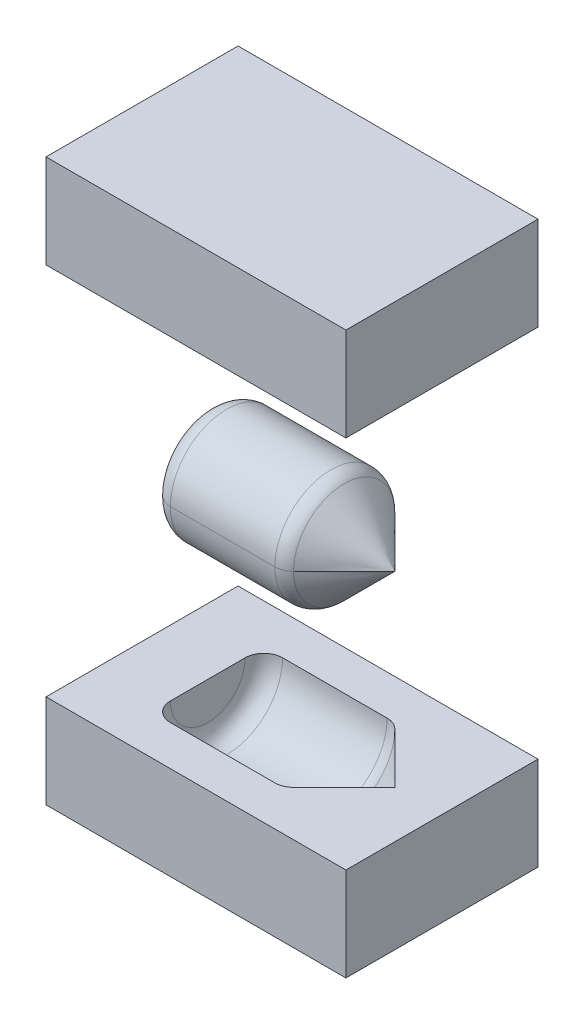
ISO-10303-21;
HEADER;
FILE_DESCRIPTION(('STEP AP214'),'2;1');
FILE_NAME('part.step','',(''),(''),'','','');
FILE_SCHEMA(('AUTOMOTIVE_DESIGN { 1 0 10303 214 1 1 1 1 }'));
ENDSEC;
DATA;
#1=APPLICATION_CONTEXT('core data for automotive mechanical design processes');
#2=APPLICATION_PROTOCOL_DEFINITION('international standard','automotive_design',2000,#1);
#3=PRODUCT_CONTEXT('',#1,'mechanical');
#4=PRODUCT('Part','Part','',(#3));
#5=PRODUCT_RELATED_PRODUCT_CATEGORY('part','',(#4));
#6=PRODUCT_DEFINITION_FORMATION('','',#4);
#7=PRODUCT_DEFINITION_CONTEXT('part definition',#1,'design');
#8=PRODUCT_DEFINITION('design','',#6,#7);
#9=PRODUCT_DEFINITION_SHAPE('','',#8);
#10=(LENGTH_UNIT() NAMED_UNIT(*) SI_UNIT(.MILLI.,.METRE.));
#11=(NAMED_UNIT(*) PLANE_ANGLE_UNIT() SI_UNIT($,.RADIAN.));
#12=(NAMED_UNIT(*) SI_UNIT($,.STERADIAN.) SOLID_ANGLE_UNIT());
#13=UNCERTAINTY_MEASURE_WITH_UNIT(LENGTH_MEASURE(1.E-05),#10,'distance_accuracy_value','');
#14=(GEOMETRIC_REPRESENTATION_CONTEXT(3) GLOBAL_UNCERTAINTY_ASSIGNED_CONTEXT((#13)) GLOBAL_UNIT_ASSIGNED_CONTEXT((#10,
#11,#12)) REPRESENTATION_CONTEXT('',''));
#15=CARTESIAN_POINT('',(0.,0.,0.));
#16=DIRECTION('',(0.,0.,1.));
#17=DIRECTION('',(1.,0.,0.));
#18=AXIS2_PLACEMENT_3D('',#15,#16,#17);
#19=CARTESIAN_POINT('',(0.,-150.,0.));
#20=DIRECTION('',(0.,-1.,0.));
#21=DIRECTION('',(0.,0.,-1.));
#22=AXIS2_PLACEMENT_3D('',#19,#20,#21);
#23=PLANE('',#22);
#24=DIRECTION('',(0.,0.,1.));
#25=VECTOR('',#24,1.);
#26=CARTESIAN_POINT('',(125.198028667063,-150.,51.3368209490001));
#27=LINE('',#26,#25);
#28=CARTESIAN_POINT('',(125.198028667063,-150.,-51.3368209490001));
#29=VERTEX_POINT('',#28);
#30=CARTESIAN_POINT('',(125.198028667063,-150.,51.3368209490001));
#31=VERTEX_POINT('',#30);
#32=EDGE_CURVE('E827',#29,#31,#27,.T.);
#33=ORIENTED_EDGE('',*,*,#32,.T.);
#34=DIRECTION('',(-1.,0.,0.));
#35=VECTOR('',#34,1.);
#36=CARTESIAN_POINT('',(-35.1366174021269,-150.,51.3368209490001));
#37=LINE('',#36,#35);
#38=CARTESIAN_POINT('',(-35.1366174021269,-150.,51.3368209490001));
#39=VERTEX_POINT('',#38);
#40=EDGE_CURVE('E835',#31,#39,#37,.T.);
#41=ORIENTED_EDGE('',*,*,#40,.T.);
#42=DIRECTION('',(0.,0.,-1.));
#43=VECTOR('',#42,1.);
#44=CARTESIAN_POINT('',(-35.1366174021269,-150.,51.3368209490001));
#45=LINE('',#44,#43);
#46=CARTESIAN_POINT('',(-35.1366174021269,-150.,-51.3368209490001));
#47=VERTEX_POINT('',#46);
#48=EDGE_CURVE('E841',#39,#47,#45,.T.);
#49=ORIENTED_EDGE('',*,*,#48,.T.);
#50=DIRECTION('',(1.,0.,0.));
#51=VECTOR('',#50,1.);
#52=CARTESIAN_POINT('',(-35.1366174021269,-150.,-51.3368209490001));
#53=LINE('',#52,#51);
#54=EDGE_CURVE('E833',#47,#29,#53,.T.);
#55=ORIENTED_EDGE('',*,*,#54,.T.);
#56=EDGE_LOOP('',(#33,#41,#49,#55));
#57=FACE_BOUND('',#56,.T.);
#58=ADVANCED_FACE('F745',(#57),#23,.T.);
#59=CARTESIAN_POINT('',(-35.1366174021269,-50.,51.3368209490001));
#60=DIRECTION('',(0.,0.,1.));
#61=DIRECTION('',(1.,0.,0.));
#62=AXIS2_PLACEMENT_3D('',#59,#60,#61);
#63=PLANE('',#62);
#64=DIRECTION('',(0.,-1.,0.));
#65=VECTOR('',#64,1.);
#66=CARTESIAN_POINT('',(125.198028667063,-50.,51.3368209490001));
#67=LINE('',#66,#65);
#68=CARTESIAN_POINT('',(125.198028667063,-100.,51.3368209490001));
#69=VERTEX_POINT('',#68);
#70=EDGE_CURVE('E823',#69,#31,#67,.T.);
#71=ORIENTED_EDGE('',*,*,#70,.F.);
#72=DIRECTION('',(-1.,0.,0.));
#73=VECTOR('',#72,1.);
#74=CARTESIAN_POINT('',(-35.1366174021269,-100.,51.3368209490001));
#75=LINE('',#74,#73);
#76=CARTESIAN_POINT('',(-35.1366174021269,-100.,51.3368209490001));
#77=VERTEX_POINT('',#76);
#78=EDGE_CURVE('E749',#69,#77,#75,.T.);
#79=ORIENTED_EDGE('',*,*,#78,.T.);
#80=DIRECTION('',(0.,-1.,0.));
#81=VECTOR('',#80,1.);
#82=CARTESIAN_POINT('',(-35.1366174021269,-50.,51.3368209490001));
#83=LINE('',#82,#81);
#84=EDGE_CURVE('E832',#77,#39,#83,.T.);
#85=ORIENTED_EDGE('',*,*,#84,.T.);
#86=ORIENTED_EDGE('',*,*,#40,.F.);
#87=EDGE_LOOP('',(#71,#79,#85,#86));
#88=FACE_BOUND('',#87,.T.);
#89=ADVANCED_FACE('F836',(#88),#63,.T.);
#90=CARTESIAN_POINT('',(-35.1366174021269,-50.,51.3368209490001));
#91=DIRECTION('',(-1.,0.,0.));
#92=DIRECTION('',(0.,0.,1.));
#93=AXIS2_PLACEMENT_3D('',#90,#91,#92);
#94=PLANE('',#93);
#95=ORIENTED_EDGE('',*,*,#84,.F.);
#96=DIRECTION('',(0.,0.,-1.));
#97=VECTOR('',#96,1.);
#98=CARTESIAN_POINT('',(-35.1366174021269,-100.,51.3368209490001));
#99=LINE('',#98,#97);
#100=CARTESIAN_POINT('',(-35.1366174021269,-100.,-51.3368209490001));
#101=VERTEX_POINT('',#100);
#102=EDGE_CURVE('E858',#77,#101,#99,.T.);
#103=ORIENTED_EDGE('',*,*,#102,.T.);
#104=DIRECTION('',(0.,-1.,0.));
#105=VECTOR('',#104,1.);
#106=CARTESIAN_POINT('',(-35.1366174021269,-50.,-51.3368209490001));
#107=LINE('',#106,#105);
#108=EDGE_CURVE('E852',#101,#47,#107,.T.);
#109=ORIENTED_EDGE('',*,*,#108,.T.);
#110=ORIENTED_EDGE('',*,*,#48,.F.);
#111=EDGE_LOOP('',(#95,#103,#109,#110));
#112=FACE_BOUND('',#111,.T.);
#113=ADVANCED_FACE('F857',(#112),#94,.T.);
#114=CARTESIAN_POINT('',(-35.1366174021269,-50.,-51.3368209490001));
#115=DIRECTION('',(0.,0.,-1.));
#116=DIRECTION('',(-1.,0.,0.));
#117=AXIS2_PLACEMENT_3D('',#114,#115,#116);
#118=PLANE('',#117);
#119=ORIENTED_EDGE('',*,*,#108,.F.);
#120=DIRECTION('',(1.,0.,0.));
#121=VECTOR('',#120,1.);
#122=CARTESIAN_POINT('',(-35.1366174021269,-100.,-51.3368209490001));
#123=LINE('',#122,#121);
#124=CARTESIAN_POINT('',(125.198028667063,-100.,-51.3368209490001));
#125=VERTEX_POINT('',#124);
#126=EDGE_CURVE('E862',#101,#125,#123,.T.);
#127=ORIENTED_EDGE('',*,*,#126,.T.);
#128=DIRECTION('',(0.,-1.,0.));
#129=VECTOR('',#128,1.);
#130=CARTESIAN_POINT('',(125.198028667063,-50.,-51.3368209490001));
#131=LINE('',#130,#129);
#132=EDGE_CURVE('E850',#125,#29,#131,.T.);
#133=ORIENTED_EDGE('',*,*,#132,.T.);
#134=ORIENTED_EDGE('',*,*,#54,.F.);
#135=EDGE_LOOP('',(#119,#127,#133,#134));
#136=FACE_BOUND('',#135,.T.);
#137=ADVANCED_FACE('F861',(#136),#118,.T.);
#138=CARTESIAN_POINT('',(125.198028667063,-50.,51.3368209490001));
#139=DIRECTION('',(1.,0.,0.));
#140=DIRECTION('',(0.,0.,-1.));
#141=AXIS2_PLACEMENT_3D('',#138,#139,#140);
#142=PLANE('',#141);
#143=ORIENTED_EDGE('',*,*,#132,.F.);
#144=DIRECTION('',(0.,0.,1.));
#145=VECTOR('',#144,1.);
#146=CARTESIAN_POINT('',(125.198028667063,-100.,51.3368209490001));
#147=LINE('',#146,#145);
#148=EDGE_CURVE('E829',#125,#69,#147,.T.);
#149=ORIENTED_EDGE('',*,*,#148,.T.);
#150=ORIENTED_EDGE('',*,*,#70,.T.);
#151=ORIENTED_EDGE('',*,*,#32,.F.);
#152=EDGE_LOOP('',(#143,#149,#150,#151));
#153=FACE_BOUND('',#152,.T.);
#154=ADVANCED_FACE('F747',(#153),#142,.T.);
#155=CARTESIAN_POINT('',(100.,-100.,0.));
#156=DIRECTION('',(-1.,0.,0.));
#157=DIRECTION('',(0.,0.,1.));
#158=AXIS2_PLACEMENT_3D('',#155,#156,#157);
#159=CONICAL_SURFACE('',#158,0.,0.785398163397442);
#160=DIRECTION('',(0.707106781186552,0.,0.707106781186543));
#161=VECTOR('',#160,1.);
#162=CARTESIAN_POINT('',(100.,-100.,0.));
#163=LINE('',#162,#161);
#164=CARTESIAN_POINT('',(72.9289321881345,-100.,-27.0710678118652));
#165=VERTEX_POINT('',#164);
#166=CARTESIAN_POINT('',(100.,-100.,0.));
#167=VERTEX_POINT('',#166);
#168=EDGE_CURVE('E864',#165,#167,#163,.T.);
#169=ORIENTED_EDGE('',*,*,#168,.F.);
#170=CARTESIAN_POINT('',(72.9289321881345,-100.,0.));
#171=DIRECTION('',(1.,0.,0.));
#172=DIRECTION('',(0.,0.,-1.));
#173=AXIS2_PLACEMENT_3D('',#170,#171,#172);
#174=CIRCLE('',#173,27.0710678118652);
#175=CARTESIAN_POINT('',(72.9289321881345,-100.,27.0710678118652));
#176=VERTEX_POINT('',#175);
#177=EDGE_CURVE('E880',#176,#165,#174,.T.);
#178=ORIENTED_EDGE('',*,*,#177,.F.);
#179=DIRECTION('',(-0.707106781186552,0.,0.707106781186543));
#180=VECTOR('',#179,1.);
#181=CARTESIAN_POINT('',(100.,-100.,0.));
#182=LINE('',#181,#180);
#183=EDGE_CURVE('E889',#167,#176,#182,.T.);
#184=ORIENTED_EDGE('',*,*,#183,.F.);
#185=EDGE_LOOP('',(#169,#178,#184));
#186=FACE_BOUND('',#185,.T.);
#187=ADVANCED_FACE('F909',(#186),#159,.F.);
#188=CARTESIAN_POINT('',(65.8578643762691,-100.,0.));
#189=DIRECTION('',(-1.,0.,0.));
#190=DIRECTION('',(0.,0.,1.));
#191=AXIS2_PLACEMENT_3D('',#188,#189,#190);
#192=TOROIDAL_SURFACE('',#191,19.9999999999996,10.);
#193=ORIENTED_EDGE('',*,*,#177,.T.);
#194=CARTESIAN_POINT('',(65.8578643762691,-100.,-19.9999999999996));
#195=DIRECTION('',(0.,1.,0.));
#196=DIRECTION('',(0.,0.,1.));
#197=AXIS2_PLACEMENT_3D('',#194,#195,#196);
#198=CIRCLE('',#197,10.);
#199=CARTESIAN_POINT('',(65.8578643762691,-100.,-29.9999999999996));
#200=VERTEX_POINT('',#199);
#201=EDGE_CURVE('E788',#200,#165,#198,.F.);
#202=ORIENTED_EDGE('',*,*,#201,.F.);
#203=CARTESIAN_POINT('',(65.8578643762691,-100.,0.));
#204=DIRECTION('',(-1.,0.,0.));
#205=DIRECTION('',(0.,0.,1.));
#206=AXIS2_PLACEMENT_3D('',#203,#204,#205);
#207=CIRCLE('',#206,29.9999999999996);
#208=CARTESIAN_POINT('',(65.8578643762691,-100.,29.9999999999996));
#209=VERTEX_POINT('',#208);
#210=EDGE_CURVE('E879',#200,#209,#207,.T.);
#211=ORIENTED_EDGE('',*,*,#210,.T.);
#212=CARTESIAN_POINT('',(65.8578643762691,-100.,19.9999999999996));
#213=DIRECTION('',(0.,-1.,0.));
#214=DIRECTION('',(0.,0.,-1.));
#215=AXIS2_PLACEMENT_3D('',#212,#213,#214);
#216=CIRCLE('',#215,10.);
#217=EDGE_CURVE('E875',#176,#209,#216,.T.);
#218=ORIENTED_EDGE('',*,*,#217,.F.);
#219=EDGE_LOOP('',(#193,#202,#211,#218));
#220=FACE_BOUND('',#219,.T.);
#221=ADVANCED_FACE('F905',(#220),#192,.F.);
#222=CARTESIAN_POINT('',(0.,-100.,0.));
#223=DIRECTION('',(-1.,0.,0.));
#224=DIRECTION('',(0.,0.,1.));
#225=AXIS2_PLACEMENT_3D('',#222,#223,#224);
#226=PLANE('',#225);
#227=CARTESIAN_POINT('',(0.,-100.,0.));
#228=DIRECTION('',(-1.,0.,0.));
#229=DIRECTION('',(0.,0.,1.));
#230=AXIS2_PLACEMENT_3D('',#227,#228,#229);
#231=CIRCLE('',#230,19.9999999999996);
#232=CARTESIAN_POINT('',(0.,-100.,-19.9999999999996));
#233=VERTEX_POINT('',#232);
#234=CARTESIAN_POINT('',(0.,-100.,19.9999999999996));
#235=VERTEX_POINT('',#234);
#236=EDGE_CURVE('E883',#233,#235,#231,.T.);
#237=ORIENTED_EDGE('',*,*,#236,.F.);
#238=DIRECTION('',(0.,0.,-1.));
#239=VECTOR('',#238,1.);
#240=CARTESIAN_POINT('',(0.,-100.,0.));
#241=LINE('',#240,#239);
#242=EDGE_CURVE('E793',#235,#233,#241,.T.);
#243=ORIENTED_EDGE('',*,*,#242,.F.);
#244=EDGE_LOOP('',(#237,#243));
#245=FACE_BOUND('',#244,.T.);
#246=ADVANCED_FACE('F916',(#245),#226,.F.);
#247=CARTESIAN_POINT('',(9.99999999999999,-100.,0.));
#248=DIRECTION('',(-1.,0.,0.));
#249=DIRECTION('',(0.,0.,1.));
#250=AXIS2_PLACEMENT_3D('',#247,#248,#249);
#251=TOROIDAL_SURFACE('',#250,19.9999999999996,10.);
#252=CARTESIAN_POINT('',(9.99999999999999,-100.,0.));
#253=DIRECTION('',(-1.,0.,0.));
#254=DIRECTION('',(0.,0.,1.));
#255=AXIS2_PLACEMENT_3D('',#252,#253,#254);
#256=CIRCLE('',#255,29.9999999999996);
#257=CARTESIAN_POINT('',(9.99999999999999,-100.,29.9999999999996));
#258=VERTEX_POINT('',#257);
#259=CARTESIAN_POINT('',(9.99999999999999,-100.,-29.9999999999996));
#260=VERTEX_POINT('',#259);
#261=EDGE_CURVE('E871',#258,#260,#256,.F.);
#262=ORIENTED_EDGE('',*,*,#261,.T.);
#263=CARTESIAN_POINT('',(9.99999999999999,-100.,-19.9999999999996));
#264=DIRECTION('',(0.,1.,0.));
#265=DIRECTION('',(0.,0.,1.));
#266=AXIS2_PLACEMENT_3D('',#263,#264,#265);
#267=CIRCLE('',#266,10.);
#268=EDGE_CURVE('E870',#233,#260,#267,.F.);
#269=ORIENTED_EDGE('',*,*,#268,.F.);
#270=ORIENTED_EDGE('',*,*,#236,.T.);
#271=CARTESIAN_POINT('',(9.99999999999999,-100.,19.9999999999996));
#272=DIRECTION('',(0.,-1.,0.));
#273=DIRECTION('',(0.,0.,-1.));
#274=AXIS2_PLACEMENT_3D('',#271,#272,#273);
#275=CIRCLE('',#274,10.);
#276=EDGE_CURVE('E867',#258,#235,#275,.T.);
#277=ORIENTED_EDGE('',*,*,#276,.F.);
#278=EDGE_LOOP('',(#262,#269,#270,#277));
#279=FACE_BOUND('',#278,.T.);
#280=ADVANCED_FACE('F948',(#279),#251,.F.);
#281=CARTESIAN_POINT('',(100.,-100.,0.));
#282=DIRECTION('',(1.,0.,0.));
#283=DIRECTION('',(0.,0.,-1.));
#284=AXIS2_PLACEMENT_3D('',#281,#282,#283);
#285=CYLINDRICAL_SURFACE('',#284,29.9999999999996);
#286=ORIENTED_EDGE('',*,*,#261,.F.);
#287=DIRECTION('',(-1.,0.,0.));
#288=VECTOR('',#287,1.);
#289=CARTESIAN_POINT('',(100.,-100.,29.9999999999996));
#290=LINE('',#289,#288);
#291=EDGE_CURVE('E14',#209,#258,#290,.T.);
#292=ORIENTED_EDGE('',*,*,#291,.F.);
#293=ORIENTED_EDGE('',*,*,#210,.F.);
#294=DIRECTION('',(1.,0.,0.));
#295=VECTOR('',#294,1.);
#296=CARTESIAN_POINT('',(100.,-100.,-29.9999999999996));
#297=LINE('',#296,#295);
#298=EDGE_CURVE('E756',#260,#200,#297,.T.);
#299=ORIENTED_EDGE('',*,*,#298,.F.);
#300=EDGE_LOOP('',(#286,#292,#293,#299));
#301=FACE_BOUND('',#300,.T.);
#302=ADVANCED_FACE('F904',(#301),#285,.F.);
#303=CARTESIAN_POINT('',(65.8578643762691,-100.,-29.9999999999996));
#304=DIRECTION('',(0.,1.,0.));
#305=DIRECTION('',(0.923879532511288,0.,0.382683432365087));
#306=AXIS2_PLACEMENT_3D('',#303,#304,#305);
#307=PLANE('',#306);
#308=ORIENTED_EDGE('',*,*,#126,.F.);
#309=ORIENTED_EDGE('',*,*,#102,.F.);
#310=ORIENTED_EDGE('',*,*,#78,.F.);
#311=ORIENTED_EDGE('',*,*,#148,.F.);
#312=EDGE_LOOP('',(#308,#309,#310,#311));
#313=FACE_BOUND('',#312,.T.);
#314=ORIENTED_EDGE('',*,*,#291,.T.);
#315=ORIENTED_EDGE('',*,*,#276,.T.);
#316=ORIENTED_EDGE('',*,*,#242,.T.);
#317=ORIENTED_EDGE('',*,*,#268,.T.);
#318=ORIENTED_EDGE('',*,*,#298,.T.);
#319=ORIENTED_EDGE('',*,*,#201,.T.);
#320=ORIENTED_EDGE('',*,*,#168,.T.);
#321=ORIENTED_EDGE('',*,*,#183,.T.);
#322=ORIENTED_EDGE('',*,*,#217,.T.);
#323=EDGE_LOOP('',(#314,#315,#316,#317,#318,#319,#320,#321,#322));
#324=FACE_BOUND('',#323,.T.);
#325=ADVANCED_FACE('F903',(#313,#324),#307,.T.);
#326=CLOSED_SHELL('',(#58,#89,#113,#137,#154,#187,#221,#246,#280,#302,#325));
#327=MANIFOLD_SOLID_BREP('B2',#326);
#328=CARTESIAN_POINT('',(100.,0.,0.));
#329=DIRECTION('',(1.,0.,0.));
#330=DIRECTION('',(0.,0.,-1.));
#331=AXIS2_PLACEMENT_3D('',#328,#329,#330);
#332=CYLINDRICAL_SURFACE('',#331,29.9999999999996);
#333=CARTESIAN_POINT('',(9.99999999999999,0.,0.));
#334=DIRECTION('',(-1.,0.,0.));
#335=DIRECTION('',(0.,0.,1.));
#336=AXIS2_PLACEMENT_3D('',#333,#334,#335);
#337=CIRCLE('',#336,29.9999999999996);
#338=CARTESIAN_POINT('',(9.99999999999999,0.,29.9999999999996));
#339=VERTEX_POINT('',#338);
#340=CARTESIAN_POINT('',(9.99999999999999,0.,-29.9999999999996));
#341=VERTEX_POINT('',#340);
#342=EDGE_CURVE('E1343',#339,#341,#337,.F.);
#343=ORIENTED_EDGE('',*,*,#342,.T.);
#344=DIRECTION('',(1.,0.,0.));
#345=VECTOR('',#344,1.);
#346=CARTESIAN_POINT('',(100.,0.,-29.9999999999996));
#347=LINE('',#346,#345);
#348=CARTESIAN_POINT('',(65.8578643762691,0.,-29.9999999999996));
#349=VERTEX_POINT('',#348);
#350=EDGE_CURVE('E743',#341,#349,#347,.T.);
#351=ORIENTED_EDGE('',*,*,#350,.T.);
#352=CARTESIAN_POINT('',(65.8578643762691,0.,0.));
#353=DIRECTION('',(-1.,0.,0.));
#354=DIRECTION('',(0.,0.,1.));
#355=AXIS2_PLACEMENT_3D('',#352,#353,#354);
#356=CIRCLE('',#355,29.9999999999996);
#357=CARTESIAN_POINT('',(65.8578643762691,0.,29.9999999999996));
#358=VERTEX_POINT('',#357);
#359=EDGE_CURVE('E1334',#349,#358,#356,.T.);
#360=ORIENTED_EDGE('',*,*,#359,.T.);
#361=DIRECTION('',(-1.,0.,0.));
#362=VECTOR('',#361,1.);
#363=CARTESIAN_POINT('',(100.,0.,29.9999999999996));
#364=LINE('',#363,#362);
#365=EDGE_CURVE('E1129',#358,#339,#364,.T.);
#366=ORIENTED_EDGE('',*,*,#365,.T.);
#367=EDGE_LOOP('',(#343,#351,#360,#366));
#368=FACE_BOUND('',#367,.T.);
#369=ADVANCED_FACE('F1120',(#368),#332,.T.);
#370=CARTESIAN_POINT('',(9.99999999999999,0.,0.));
#371=DIRECTION('',(-1.,0.,0.));
#372=DIRECTION('',(0.,0.,1.));
#373=AXIS2_PLACEMENT_3D('',#370,#371,#372);
#374=TOROIDAL_SURFACE('',#373,19.9999999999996,10.);
#375=ORIENTED_EDGE('',*,*,#342,.F.);
#376=CARTESIAN_POINT('',(9.99999999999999,0.,19.9999999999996));
#377=DIRECTION('',(0.,-1.,0.));
#378=DIRECTION('',(0.,0.,1.));
#379=AXIS2_PLACEMENT_3D('',#376,#377,#378);
#380=CIRCLE('',#379,10.);
#381=CARTESIAN_POINT('',(0.,0.,19.9999999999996));
#382=VERTEX_POINT('',#381);
#383=EDGE_CURVE('E1195',#339,#382,#380,.T.);
#384=ORIENTED_EDGE('',*,*,#383,.T.);
#385=CARTESIAN_POINT('',(0.,0.,0.));
#386=DIRECTION('',(-1.,0.,0.));
#387=DIRECTION('',(0.,0.,1.));
#388=AXIS2_PLACEMENT_3D('',#385,#386,#387);
#389=CIRCLE('',#388,19.9999999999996);
#390=CARTESIAN_POINT('',(0.,0.,-19.9999999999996));
#391=VERTEX_POINT('',#390);
#392=EDGE_CURVE('E1330',#391,#382,#389,.T.);
#393=ORIENTED_EDGE('',*,*,#392,.F.);
#394=CARTESIAN_POINT('',(9.99999999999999,0.,-19.9999999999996));
#395=DIRECTION('',(0.,-1.,0.));
#396=DIRECTION('',(0.,0.,1.));
#397=AXIS2_PLACEMENT_3D('',#394,#395,#396);
#398=CIRCLE('',#397,10.);
#399=EDGE_CURVE('E1191',#391,#341,#398,.T.);
#400=ORIENTED_EDGE('',*,*,#399,.T.);
#401=EDGE_LOOP('',(#375,#384,#393,#400));
#402=FACE_BOUND('',#401,.T.);
#403=ADVANCED_FACE('F1218',(#402),#374,.T.);
#404=CARTESIAN_POINT('',(0.,0.,0.));
#405=DIRECTION('',(-1.,0.,0.));
#406=DIRECTION('',(0.,0.,1.));
#407=AXIS2_PLACEMENT_3D('',#404,#405,#406);
#408=PLANE('',#407);
#409=ORIENTED_EDGE('',*,*,#392,.T.);
#410=DIRECTION('',(0.,0.,-1.));
#411=VECTOR('',#410,1.);
#412=CARTESIAN_POINT('',(0.,0.,0.));
#413=LINE('',#412,#411);
#414=EDGE_CURVE('E1172',#382,#391,#413,.T.);
#415=ORIENTED_EDGE('',*,*,#414,.T.);
#416=EDGE_LOOP('',(#409,#415));
#417=FACE_BOUND('',#416,.T.);
#418=ADVANCED_FACE('F1248',(#417),#408,.T.);
#419=CARTESIAN_POINT('',(100.,0.,0.));
#420=DIRECTION('',(-1.,0.,0.));
#421=DIRECTION('',(0.,0.,1.));
#422=AXIS2_PLACEMENT_3D('',#419,#420,#421);
#423=CONICAL_SURFACE('',#422,0.,0.785398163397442);
#424=DIRECTION('',(0.707106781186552,0.,0.707106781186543));
#425=VECTOR('',#424,1.);
#426=CARTESIAN_POINT('',(100.,0.,0.));
#427=LINE('',#426,#425);
#428=CARTESIAN_POINT('',(72.9289321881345,0.,-27.0710678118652));
#429=VERTEX_POINT('',#428);
#430=CARTESIAN_POINT('',(100.,0.,0.));
#431=VERTEX_POINT('',#430);
#432=EDGE_CURVE('E1165',#429,#431,#427,.T.);
#433=ORIENTED_EDGE('',*,*,#432,.T.);
#434=DIRECTION('',(-0.707106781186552,0.,0.707106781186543));
#435=VECTOR('',#434,1.);
#436=CARTESIAN_POINT('',(100.,0.,0.));
#437=LINE('',#436,#435);
#438=CARTESIAN_POINT('',(72.9289321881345,0.,27.0710678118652));
#439=VERTEX_POINT('',#438);
#440=EDGE_CURVE('E1162',#431,#439,#437,.T.);
#441=ORIENTED_EDGE('',*,*,#440,.T.);
#442=CARTESIAN_POINT('',(72.9289321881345,0.,0.));
#443=DIRECTION('',(1.,0.,0.));
#444=DIRECTION('',(0.,0.,-1.));
#445=AXIS2_PLACEMENT_3D('',#442,#443,#444);
#446=CIRCLE('',#445,27.0710678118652);
#447=EDGE_CURVE('E1176',#439,#429,#446,.T.);
#448=ORIENTED_EDGE('',*,*,#447,.T.);
#449=EDGE_LOOP('',(#433,#441,#448));
#450=FACE_BOUND('',#449,.T.);
#451=ADVANCED_FACE('F1174',(#450),#423,.T.);
#452=CARTESIAN_POINT('',(65.8578643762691,0.,0.));
#453=DIRECTION('',(-1.,0.,0.));
#454=DIRECTION('',(0.,0.,1.));
#455=AXIS2_PLACEMENT_3D('',#452,#453,#454);
#456=TOROIDAL_SURFACE('',#455,19.9999999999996,10.);
#457=ORIENTED_EDGE('',*,*,#447,.F.);
#458=CARTESIAN_POINT('',(65.8578643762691,0.,19.9999999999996));
#459=DIRECTION('',(0.,-1.,0.));
#460=DIRECTION('',(0.,0.,1.));
#461=AXIS2_PLACEMENT_3D('',#458,#459,#460);
#462=CIRCLE('',#461,10.);
#463=EDGE_CURVE('E1179',#439,#358,#462,.T.);
#464=ORIENTED_EDGE('',*,*,#463,.T.);
#465=ORIENTED_EDGE('',*,*,#359,.F.);
#466=CARTESIAN_POINT('',(65.8578643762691,0.,-19.9999999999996));
#467=DIRECTION('',(0.,-1.,0.));
#468=DIRECTION('',(0.,0.,1.));
#469=AXIS2_PLACEMENT_3D('',#466,#467,#468);
#470=CIRCLE('',#469,10.);
#471=EDGE_CURVE('E1184',#349,#429,#470,.T.);
#472=ORIENTED_EDGE('',*,*,#471,.T.);
#473=EDGE_LOOP('',(#457,#464,#465,#472));
#474=FACE_BOUND('',#473,.T.);
#475=ADVANCED_FACE('F1210',(#474),#456,.T.);
#476=ORIENTED_EDGE('',*,*,#414,.F.);
#477=EDGE_CURVE('E1203',#382,#391,#389,.T.);
#478=ORIENTED_EDGE('',*,*,#477,.T.);
#479=EDGE_LOOP('',(#476,#478));
#480=FACE_BOUND('',#479,.T.);
#481=ADVANCED_FACE('F1233',(#480),#408,.T.);
#482=ORIENTED_EDGE('',*,*,#350,.F.);
#483=EDGE_CURVE('E1341',#341,#339,#337,.F.);
#484=ORIENTED_EDGE('',*,*,#483,.T.);
#485=ORIENTED_EDGE('',*,*,#365,.F.);
#486=EDGE_CURVE('E1340',#358,#349,#356,.T.);
#487=ORIENTED_EDGE('',*,*,#486,.T.);
#488=EDGE_LOOP('',(#482,#484,#485,#487));
#489=FACE_BOUND('',#488,.T.);
#490=ADVANCED_FACE('F1225',(#489),#332,.T.);
#491=ORIENTED_EDGE('',*,*,#440,.F.);
#492=ORIENTED_EDGE('',*,*,#432,.F.);
#493=EDGE_CURVE('E1168',#429,#439,#446,.T.);
#494=ORIENTED_EDGE('',*,*,#493,.T.);
#495=EDGE_LOOP('',(#491,#492,#494));
#496=FACE_BOUND('',#495,.T.);
#497=ADVANCED_FACE('F1164',(#496),#423,.T.);
#498=ORIENTED_EDGE('',*,*,#463,.F.);
#499=ORIENTED_EDGE('',*,*,#493,.F.);
#500=ORIENTED_EDGE('',*,*,#471,.F.);
#501=ORIENTED_EDGE('',*,*,#486,.F.);
#502=EDGE_LOOP('',(#498,#499,#500,#501));
#503=FACE_BOUND('',#502,.T.);
#504=ADVANCED_FACE('F1204',(#503),#456,.T.);
#505=ORIENTED_EDGE('',*,*,#383,.F.);
#506=ORIENTED_EDGE('',*,*,#483,.F.);
#507=ORIENTED_EDGE('',*,*,#399,.F.);
#508=ORIENTED_EDGE('',*,*,#477,.F.);
#509=EDGE_LOOP('',(#505,#506,#507,#508));
#510=FACE_BOUND('',#509,.T.);
#511=ADVANCED_FACE('F1122',(#510),#374,.T.);
#512=CLOSED_SHELL('',(#369,#403,#418,#451,#475,#481,#490,#497,#504,#511));
#513=MANIFOLD_SOLID_BREP('B8',#512);
#514=CARTESIAN_POINT('',(125.198028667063,150.,51.3368209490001));
#515=DIRECTION('',(1.,0.,0.));
#516=DIRECTION('',(0.,0.,-1.));
#517=AXIS2_PLACEMENT_3D('',#514,#515,#516);
#518=PLANE('',#517);
#519=DIRECTION('',(0.,0.,1.));
#520=VECTOR('',#519,1.);
#521=CARTESIAN_POINT('',(125.198028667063,100.,51.3368209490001));
#522=LINE('',#521,#520);
#523=CARTESIAN_POINT('',(125.198028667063,100.,-51.3368209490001));
#524=VERTEX_POINT('',#523);
#525=CARTESIAN_POINT('',(125.198028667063,100.,51.3368209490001));
#526=VERTEX_POINT('',#525);
#527=EDGE_CURVE('E1467',#524,#526,#522,.T.);
#528=ORIENTED_EDGE('',*,*,#527,.F.);
#529=DIRECTION('',(0.,-1.,0.));
#530=VECTOR('',#529,1.);
#531=CARTESIAN_POINT('',(125.198028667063,150.,-51.3368209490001));
#532=LINE('',#531,#530);
#533=CARTESIAN_POINT('',(125.198028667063,150.,-51.3368209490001));
#534=VERTEX_POINT('',#533);
#535=EDGE_CURVE('E1465',#534,#524,#532,.T.);
#536=ORIENTED_EDGE('',*,*,#535,.F.);
#537=DIRECTION('',(0.,0.,1.));
#538=VECTOR('',#537,1.);
#539=CARTESIAN_POINT('',(125.198028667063,150.,51.3368209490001));
#540=LINE('',#539,#538);
#541=CARTESIAN_POINT('',(125.198028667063,150.,51.3368209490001));
#542=VERTEX_POINT('',#541);
#543=EDGE_CURVE('E1469',#534,#542,#540,.T.);
#544=ORIENTED_EDGE('',*,*,#543,.T.);
#545=DIRECTION('',(0.,-1.,0.));
#546=VECTOR('',#545,1.);
#547=CARTESIAN_POINT('',(125.198028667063,150.,51.3368209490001));
#548=LINE('',#547,#546);
#549=EDGE_CURVE('E1481',#542,#526,#548,.T.);
#550=ORIENTED_EDGE('',*,*,#549,.T.);
#551=EDGE_LOOP('',(#528,#536,#544,#550));
#552=FACE_BOUND('',#551,.T.);
#553=ADVANCED_FACE('F1364',(#552),#518,.T.);
#554=CARTESIAN_POINT('',(-35.1366174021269,150.,-51.3368209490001));
#555=DIRECTION('',(0.,0.,-1.));
#556=DIRECTION('',(-1.,0.,0.));
#557=AXIS2_PLACEMENT_3D('',#554,#555,#556);
#558=PLANE('',#557);
#559=DIRECTION('',(1.,0.,0.));
#560=VECTOR('',#559,1.);
#561=CARTESIAN_POINT('',(-35.1366174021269,100.,-51.3368209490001));
#562=LINE('',#561,#560);
#563=CARTESIAN_POINT('',(-35.1366174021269,100.,-51.3368209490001));
#564=VERTEX_POINT('',#563);
#565=EDGE_CURVE('E1400',#564,#524,#562,.T.);
#566=ORIENTED_EDGE('',*,*,#565,.F.);
#567=DIRECTION('',(0.,-1.,0.));
#568=VECTOR('',#567,1.);
#569=CARTESIAN_POINT('',(-35.1366174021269,150.,-51.3368209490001));
#570=LINE('',#569,#568);
#571=CARTESIAN_POINT('',(-35.1366174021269,150.,-51.3368209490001));
#572=VERTEX_POINT('',#571);
#573=EDGE_CURVE('E1484',#572,#564,#570,.T.);
#574=ORIENTED_EDGE('',*,*,#573,.F.);
#575=DIRECTION('',(1.,0.,0.));
#576=VECTOR('',#575,1.);
#577=CARTESIAN_POINT('',(-35.1366174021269,150.,-51.3368209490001));
#578=LINE('',#577,#576);
#579=EDGE_CURVE('E1478',#572,#534,#578,.T.);
#580=ORIENTED_EDGE('',*,*,#579,.T.);
#581=ORIENTED_EDGE('',*,*,#535,.T.);
#582=EDGE_LOOP('',(#566,#574,#580,#581));
#583=FACE_BOUND('',#582,.T.);
#584=ADVANCED_FACE('F1531',(#583),#558,.T.);
#585=CARTESIAN_POINT('',(-35.1366174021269,150.,51.3368209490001));
#586=DIRECTION('',(-1.,0.,0.));
#587=DIRECTION('',(0.,0.,1.));
#588=AXIS2_PLACEMENT_3D('',#585,#586,#587);
#589=PLANE('',#588);
#590=DIRECTION('',(0.,0.,-1.));
#591=VECTOR('',#590,1.);
#592=CARTESIAN_POINT('',(-35.1366174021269,100.,51.3368209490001));
#593=LINE('',#592,#591);
#594=CARTESIAN_POINT('',(-35.1366174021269,100.,51.3368209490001));
#595=VERTEX_POINT('',#594);
#596=EDGE_CURVE('E1405',#595,#564,#593,.T.);
#597=ORIENTED_EDGE('',*,*,#596,.F.);
#598=DIRECTION('',(0.,-1.,0.));
#599=VECTOR('',#598,1.);
#600=CARTESIAN_POINT('',(-35.1366174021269,150.,51.3368209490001));
#601=LINE('',#600,#599);
#602=CARTESIAN_POINT('',(-35.1366174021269,150.,51.3368209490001));
#603=VERTEX_POINT('',#602);
#604=EDGE_CURVE('E1487',#603,#595,#601,.T.);
#605=ORIENTED_EDGE('',*,*,#604,.F.);
#606=DIRECTION('',(0.,0.,-1.));
#607=VECTOR('',#606,1.);
#608=CARTESIAN_POINT('',(-35.1366174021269,150.,51.3368209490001));
#609=LINE('',#608,#607);
#610=EDGE_CURVE('E1475',#603,#572,#609,.T.);
#611=ORIENTED_EDGE('',*,*,#610,.T.);
#612=ORIENTED_EDGE('',*,*,#573,.T.);
#613=EDGE_LOOP('',(#597,#605,#611,#612));
#614=FACE_BOUND('',#613,.T.);
#615=ADVANCED_FACE('F1535',(#614),#589,.T.);
#616=CARTESIAN_POINT('',(-35.1366174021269,150.,51.3368209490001));
#617=DIRECTION('',(0.,0.,1.));
#618=DIRECTION('',(1.,0.,0.));
#619=AXIS2_PLACEMENT_3D('',#616,#617,#618);
#620=PLANE('',#619);
#621=DIRECTION('',(-1.,0.,0.));
#622=VECTOR('',#621,1.);
#623=CARTESIAN_POINT('',(-35.1366174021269,100.,51.3368209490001));
#624=LINE('',#623,#622);
#625=EDGE_CURVE('E1367',#526,#595,#624,.T.);
#626=ORIENTED_EDGE('',*,*,#625,.F.);
#627=ORIENTED_EDGE('',*,*,#549,.F.);
#628=DIRECTION('',(-1.,0.,0.));
#629=VECTOR('',#628,1.);
#630=CARTESIAN_POINT('',(-35.1366174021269,150.,51.3368209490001));
#631=LINE('',#630,#629);
#632=EDGE_CURVE('E1472',#542,#603,#631,.T.);
#633=ORIENTED_EDGE('',*,*,#632,.T.);
#634=ORIENTED_EDGE('',*,*,#604,.T.);
#635=EDGE_LOOP('',(#626,#627,#633,#634));
#636=FACE_BOUND('',#635,.T.);
#637=ADVANCED_FACE('F1498',(#636),#620,.T.);
#638=CARTESIAN_POINT('',(0.,150.,0.));
#639=DIRECTION('',(0.,-1.,0.));
#640=DIRECTION('',(0.,0.,-1.));
#641=AXIS2_PLACEMENT_3D('',#638,#639,#640);
#642=PLANE('',#641);
#643=ORIENTED_EDGE('',*,*,#543,.F.);
#644=ORIENTED_EDGE('',*,*,#579,.F.);
#645=ORIENTED_EDGE('',*,*,#610,.F.);
#646=ORIENTED_EDGE('',*,*,#632,.F.);
#647=EDGE_LOOP('',(#643,#644,#645,#646));
#648=FACE_BOUND('',#647,.T.);
#649=ADVANCED_FACE('F1520',(#648),#642,.F.);
#650=CARTESIAN_POINT('',(100.,100.,0.));
#651=DIRECTION('',(-1.,0.,0.));
#652=DIRECTION('',(0.,0.,1.));
#653=AXIS2_PLACEMENT_3D('',#650,#651,#652);
#654=CONICAL_SURFACE('',#653,0.,0.785398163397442);
#655=DIRECTION('',(-0.707106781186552,0.,0.707106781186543));
#656=VECTOR('',#655,1.);
#657=CARTESIAN_POINT('',(100.,100.,0.));
#658=LINE('',#657,#656);
#659=CARTESIAN_POINT('',(100.,100.,0.));
#660=VERTEX_POINT('',#659);
#661=CARTESIAN_POINT('',(72.9289321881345,100.,27.0710678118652));
#662=VERTEX_POINT('',#661);
#663=EDGE_CURVE('E1500',#660,#662,#658,.T.);
#664=ORIENTED_EDGE('',*,*,#663,.T.);
#665=CARTESIAN_POINT('',(72.9289321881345,100.,0.));
#666=DIRECTION('',(1.,0.,0.));
#667=DIRECTION('',(0.,0.,-1.));
#668=AXIS2_PLACEMENT_3D('',#665,#666,#667);
#669=CIRCLE('',#668,27.0710678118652);
#670=CARTESIAN_POINT('',(72.9289321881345,100.,-27.0710678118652));
#671=VERTEX_POINT('',#670);
#672=EDGE_CURVE('E1453',#671,#662,#669,.T.);
#673=ORIENTED_EDGE('',*,*,#672,.F.);
#674=DIRECTION('',(0.707106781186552,0.,0.707106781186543));
#675=VECTOR('',#674,1.);
#676=CARTESIAN_POINT('',(100.,100.,0.));
#677=LINE('',#676,#675);
#678=EDGE_CURVE('E1447',#671,#660,#677,.T.);
#679=ORIENTED_EDGE('',*,*,#678,.T.);
#680=EDGE_LOOP('',(#664,#673,#679));
#681=FACE_BOUND('',#680,.T.);
#682=ADVANCED_FACE('F1518',(#681),#654,.F.);
#683=CARTESIAN_POINT('',(65.8578643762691,100.,0.));
#684=DIRECTION('',(-1.,0.,0.));
#685=DIRECTION('',(0.,0.,1.));
#686=AXIS2_PLACEMENT_3D('',#683,#684,#685);
#687=TOROIDAL_SURFACE('',#686,19.9999999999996,10.);
#688=CARTESIAN_POINT('',(65.8578643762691,100.,19.9999999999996));
#689=DIRECTION('',(0.,-1.,0.));
#690=DIRECTION('',(0.,0.,-1.));
#691=AXIS2_PLACEMENT_3D('',#688,#689,#690);
#692=CIRCLE('',#691,10.);
#693=CARTESIAN_POINT('',(65.8578643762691,100.,29.9999999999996));
#694=VERTEX_POINT('',#693);
#695=EDGE_CURVE('E1426',#662,#694,#692,.T.);
#696=ORIENTED_EDGE('',*,*,#695,.T.);
#697=CARTESIAN_POINT('',(65.8578643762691,100.,0.));
#698=DIRECTION('',(-1.,0.,0.));
#699=DIRECTION('',(0.,0.,1.));
#700=AXIS2_PLACEMENT_3D('',#697,#698,#699);
#701=CIRCLE('',#700,29.9999999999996);
#702=CARTESIAN_POINT('',(65.8578643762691,100.,-29.9999999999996));
#703=VERTEX_POINT('',#702);
#704=EDGE_CURVE('E1433',#694,#703,#701,.T.);
#705=ORIENTED_EDGE('',*,*,#704,.T.);
#706=CARTESIAN_POINT('',(65.8578643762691,100.,-19.9999999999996));
#707=DIRECTION('',(0.,1.,0.));
#708=DIRECTION('',(0.,0.,1.));
#709=AXIS2_PLACEMENT_3D('',#706,#707,#708);
#710=CIRCLE('',#709,10.);
#711=EDGE_CURVE('E1440',#703,#671,#710,.F.);
#712=ORIENTED_EDGE('',*,*,#711,.T.);
#713=ORIENTED_EDGE('',*,*,#672,.T.);
#714=EDGE_LOOP('',(#696,#705,#712,#713));
#715=FACE_BOUND('',#714,.T.);
#716=ADVANCED_FACE('F1439',(#715),#687,.F.);
#717=CARTESIAN_POINT('',(0.,100.,0.));
#718=DIRECTION('',(-1.,0.,0.));
#719=DIRECTION('',(0.,0.,1.));
#720=AXIS2_PLACEMENT_3D('',#717,#718,#719);
#721=PLANE('',#720);
#722=DIRECTION('',(0.,0.,-1.));
#723=VECTOR('',#722,1.);
#724=CARTESIAN_POINT('',(0.,100.,0.));
#725=LINE('',#724,#723);
#726=CARTESIAN_POINT('',(0.,100.,19.9999999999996));
#727=VERTEX_POINT('',#726);
#728=CARTESIAN_POINT('',(0.,100.,-19.9999999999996));
#729=VERTEX_POINT('',#728);
#730=EDGE_CURVE('E1442',#727,#729,#725,.T.);
#731=ORIENTED_EDGE('',*,*,#730,.T.);
#732=CARTESIAN_POINT('',(0.,100.,0.));
#733=DIRECTION('',(-1.,0.,0.));
#734=DIRECTION('',(0.,0.,1.));
#735=AXIS2_PLACEMENT_3D('',#732,#733,#734);
#736=CIRCLE('',#735,19.9999999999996);
#737=EDGE_CURVE('E1463',#727,#729,#736,.T.);
#738=ORIENTED_EDGE('',*,*,#737,.F.);
#739=EDGE_LOOP('',(#731,#738));
#740=FACE_BOUND('',#739,.T.);
#741=ADVANCED_FACE('F1517',(#740),#721,.F.);
#742=CARTESIAN_POINT('',(9.99999999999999,100.,0.));
#743=DIRECTION('',(-1.,0.,0.));
#744=DIRECTION('',(0.,0.,1.));
#745=AXIS2_PLACEMENT_3D('',#742,#743,#744);
#746=TOROIDAL_SURFACE('',#745,19.9999999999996,10.);
#747=CARTESIAN_POINT('',(9.99999999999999,100.,19.9999999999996));
#748=DIRECTION('',(0.,-1.,0.));
#749=DIRECTION('',(0.,0.,-1.));
#750=AXIS2_PLACEMENT_3D('',#747,#748,#749);
#751=CIRCLE('',#750,10.);
#752=CARTESIAN_POINT('',(9.99999999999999,100.,29.9999999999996));
#753=VERTEX_POINT('',#752);
#754=EDGE_CURVE('E1460',#753,#727,#751,.T.);
#755=ORIENTED_EDGE('',*,*,#754,.T.);
#756=ORIENTED_EDGE('',*,*,#737,.T.);
#757=CARTESIAN_POINT('',(9.99999999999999,100.,-19.9999999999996));
#758=DIRECTION('',(0.,1.,0.));
#759=DIRECTION('',(0.,0.,1.));
#760=AXIS2_PLACEMENT_3D('',#757,#758,#759);
#761=CIRCLE('',#760,10.);
#762=CARTESIAN_POINT('',(9.99999999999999,100.,-29.9999999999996));
#763=VERTEX_POINT('',#762);
#764=EDGE_CURVE('E1383',#729,#763,#761,.F.);
#765=ORIENTED_EDGE('',*,*,#764,.T.);
#766=CARTESIAN_POINT('',(9.99999999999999,100.,0.));
#767=DIRECTION('',(-1.,0.,0.));
#768=DIRECTION('',(0.,0.,1.));
#769=AXIS2_PLACEMENT_3D('',#766,#767,#768);
#770=CIRCLE('',#769,29.9999999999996);
#771=EDGE_CURVE('E1434',#763,#753,#770,.F.);
#772=ORIENTED_EDGE('',*,*,#771,.T.);
#773=EDGE_LOOP('',(#755,#756,#765,#772));
#774=FACE_BOUND('',#773,.T.);
#775=ADVANCED_FACE('F1513',(#774),#746,.F.);
#776=CARTESIAN_POINT('',(100.,100.,0.));
#777=DIRECTION('',(1.,0.,0.));
#778=DIRECTION('',(0.,0.,-1.));
#779=AXIS2_PLACEMENT_3D('',#776,#777,#778);
#780=CYLINDRICAL_SURFACE('',#779,29.9999999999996);
#781=DIRECTION('',(1.,0.,0.));
#782=VECTOR('',#781,1.);
#783=CARTESIAN_POINT('',(100.,100.,-29.9999999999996));
#784=LINE('',#783,#782);
#785=EDGE_CURVE('E1374',#763,#703,#784,.T.);
#786=ORIENTED_EDGE('',*,*,#785,.T.);
#787=ORIENTED_EDGE('',*,*,#704,.F.);
#788=DIRECTION('',(-1.,0.,0.));
#789=VECTOR('',#788,1.);
#790=CARTESIAN_POINT('',(100.,100.,29.9999999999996));
#791=LINE('',#790,#789);
#792=EDGE_CURVE('E1118',#694,#753,#791,.T.);
#793=ORIENTED_EDGE('',*,*,#792,.T.);
#794=ORIENTED_EDGE('',*,*,#771,.F.);
#795=EDGE_LOOP('',(#786,#787,#793,#794));
#796=FACE_BOUND('',#795,.T.);
#797=ADVANCED_FACE('F1432',(#796),#780,.F.);
#798=CARTESIAN_POINT('',(65.8578643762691,100.,-29.9999999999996));
#799=DIRECTION('',(0.,1.,0.));
#800=DIRECTION('',(0.923879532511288,0.,0.382683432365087));
#801=AXIS2_PLACEMENT_3D('',#798,#799,#800);
#802=PLANE('',#801);
#803=ORIENTED_EDGE('',*,*,#527,.T.);
#804=ORIENTED_EDGE('',*,*,#625,.T.);
#805=ORIENTED_EDGE('',*,*,#596,.T.);
#806=ORIENTED_EDGE('',*,*,#565,.T.);
#807=EDGE_LOOP('',(#803,#804,#805,#806));
#808=FACE_BOUND('',#807,.T.);
#809=ORIENTED_EDGE('',*,*,#792,.F.);
#810=ORIENTED_EDGE('',*,*,#695,.F.);
#811=ORIENTED_EDGE('',*,*,#663,.F.);
#812=ORIENTED_EDGE('',*,*,#678,.F.);
#813=ORIENTED_EDGE('',*,*,#711,.F.);
#814=ORIENTED_EDGE('',*,*,#785,.F.);
#815=ORIENTED_EDGE('',*,*,#764,.F.);
#816=ORIENTED_EDGE('',*,*,#730,.F.);
#817=ORIENTED_EDGE('',*,*,#754,.F.);
#818=EDGE_LOOP('',(#809,#810,#811,#812,#813,#814,#815,#816,#817));
#819=FACE_BOUND('',#818,.T.);
#820=ADVANCED_FACE('F1445',(#808,#819),#802,.F.);
#821=CLOSED_SHELL('',(#553,#584,#615,#637,#649,#682,#716,#741,#775,#797,#820));
#822=MANIFOLD_SOLID_BREP('B737',#821);
#823=ADVANCED_BREP_SHAPE_REPRESENTATION('',(#18,#327,#513,#822),#14);
#824=SHAPE_DEFINITION_REPRESENTATION(#9,#823);
ENDSEC;
END-ISO-10303-21;
